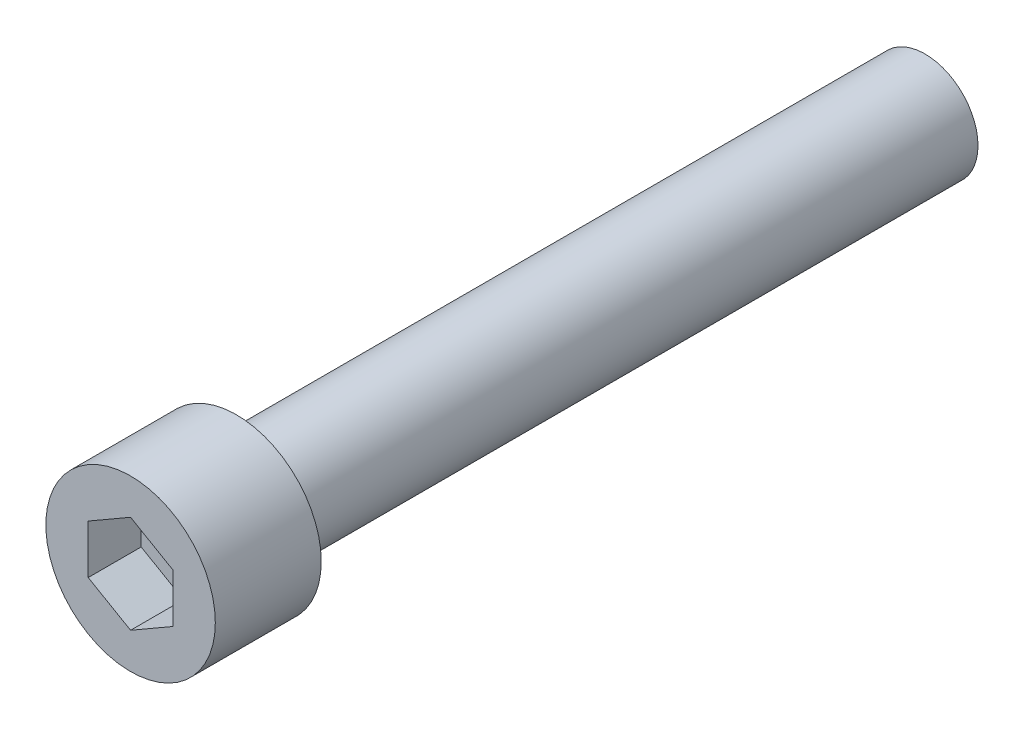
ISO-10303-21;
HEADER;
FILE_DESCRIPTION(('STEP AP214'),'2;1');
FILE_NAME('part.step','',(''),(''),'','','');
FILE_SCHEMA(('AUTOMOTIVE_DESIGN { 1 0 10303 214 1 1 1 1 }'));
ENDSEC;
DATA;
#1=APPLICATION_CONTEXT('core data for automotive mechanical design processes');
#2=APPLICATION_PROTOCOL_DEFINITION('international standard','automotive_design',2000,#1);
#3=PRODUCT_CONTEXT('',#1,'mechanical');
#4=PRODUCT('Part','Part','',(#3));
#5=PRODUCT_RELATED_PRODUCT_CATEGORY('part','',(#4));
#6=PRODUCT_DEFINITION_FORMATION('','',#4);
#7=PRODUCT_DEFINITION_CONTEXT('part definition',#1,'design');
#8=PRODUCT_DEFINITION('design','',#6,#7);
#9=PRODUCT_DEFINITION_SHAPE('','',#8);
#10=(LENGTH_UNIT() NAMED_UNIT(*) SI_UNIT(.MILLI.,.METRE.));
#11=(NAMED_UNIT(*) PLANE_ANGLE_UNIT() SI_UNIT($,.RADIAN.));
#12=(NAMED_UNIT(*) SI_UNIT($,.STERADIAN.) SOLID_ANGLE_UNIT());
#13=UNCERTAINTY_MEASURE_WITH_UNIT(LENGTH_MEASURE(1.E-05),#10,'distance_accuracy_value','');
#14=(GEOMETRIC_REPRESENTATION_CONTEXT(3) GLOBAL_UNCERTAINTY_ASSIGNED_CONTEXT((#13)) GLOBAL_UNIT_ASSIGNED_CONTEXT((#10,
#11,#12)) REPRESENTATION_CONTEXT('',''));
#15=CARTESIAN_POINT('',(0.,0.,0.));
#16=DIRECTION('',(0.,0.,1.));
#17=DIRECTION('',(1.,0.,0.));
#18=AXIS2_PLACEMENT_3D('',#15,#16,#17);
#19=CARTESIAN_POINT('',(0.,4.618802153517,5.));
#20=DIRECTION('',(-0.5,-0.86602540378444,0.));
#21=DIRECTION('',(0.86602540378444,-0.5,0.));
#22=AXIS2_PLACEMENT_3D('',#19,#20,#21);
#23=PLANE('',#22);
#24=DIRECTION('',(0.,0.,1.));
#25=VECTOR('',#24,1.);
#26=CARTESIAN_POINT('',(4.,2.30940107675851,5.));
#27=LINE('',#26,#25);
#28=CARTESIAN_POINT('',(4.,2.30940107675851,5.));
#29=VERTEX_POINT('',#28);
#30=CARTESIAN_POINT('',(4.,2.30940107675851,10.));
#31=VERTEX_POINT('',#30);
#32=EDGE_CURVE('E63',#29,#31,#27,.T.);
#33=ORIENTED_EDGE('',*,*,#32,.T.);
#34=DIRECTION('',(0.86602540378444,-0.5,0.));
#35=VECTOR('',#34,1.);
#36=CARTESIAN_POINT('',(0.,4.618802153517,10.));
#37=LINE('',#36,#35);
#38=CARTESIAN_POINT('',(0.,4.618802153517,10.));
#39=VERTEX_POINT('',#38);
#40=EDGE_CURVE('E29',#39,#31,#37,.T.);
#41=ORIENTED_EDGE('',*,*,#40,.F.);
#42=DIRECTION('',(0.,0.,1.));
#43=VECTOR('',#42,1.);
#44=CARTESIAN_POINT('',(0.,4.618802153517,5.));
#45=LINE('',#44,#43);
#46=CARTESIAN_POINT('',(0.,4.618802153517,5.));
#47=VERTEX_POINT('',#46);
#48=EDGE_CURVE('E33',#47,#39,#45,.T.);
#49=ORIENTED_EDGE('',*,*,#48,.F.);
#50=DIRECTION('',(0.86602540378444,-0.5,0.));
#51=VECTOR('',#50,1.);
#52=CARTESIAN_POINT('',(0.,4.618802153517,5.));
#53=LINE('',#52,#51);
#54=EDGE_CURVE('E65',#47,#29,#53,.T.);
#55=ORIENTED_EDGE('',*,*,#54,.T.);
#56=EDGE_LOOP('',(#33,#41,#49,#55));
#57=FACE_BOUND('',#56,.T.);
#58=ADVANCED_FACE('F14',(#57),#23,.T.);
#59=CARTESIAN_POINT('',(4.,-2.30940107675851,5.));
#60=DIRECTION('',(1.,0.,0.));
#61=DIRECTION('',(0.,1.,0.));
#62=AXIS2_PLACEMENT_3D('',#59,#60,#61);
#63=PLANE('',#62);
#64=DIRECTION('',(0.,0.,1.));
#65=VECTOR('',#64,1.);
#66=CARTESIAN_POINT('',(4.,-2.30940107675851,5.));
#67=LINE('',#66,#65);
#68=CARTESIAN_POINT('',(4.,-2.30940107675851,5.));
#69=VERTEX_POINT('',#68);
#70=CARTESIAN_POINT('',(4.,-2.30940107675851,10.));
#71=VERTEX_POINT('',#70);
#72=EDGE_CURVE('E70',#69,#71,#67,.T.);
#73=ORIENTED_EDGE('',*,*,#72,.T.);
#74=DIRECTION('',(0.,1.,0.));
#75=VECTOR('',#74,1.);
#76=CARTESIAN_POINT('',(4.,-2.30940107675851,10.));
#77=LINE('',#76,#75);
#78=EDGE_CURVE('E73',#71,#31,#77,.T.);
#79=ORIENTED_EDGE('',*,*,#78,.T.);
#80=ORIENTED_EDGE('',*,*,#32,.F.);
#81=DIRECTION('',(0.,1.,0.));
#82=VECTOR('',#81,1.);
#83=CARTESIAN_POINT('',(4.,-2.30940107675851,5.));
#84=LINE('',#83,#82);
#85=EDGE_CURVE('E99',#69,#29,#84,.T.);
#86=ORIENTED_EDGE('',*,*,#85,.F.);
#87=EDGE_LOOP('',(#73,#79,#80,#86));
#88=FACE_BOUND('',#87,.T.);
#89=ADVANCED_FACE('F74',(#88),#63,.F.);
#90=CARTESIAN_POINT('',(0.,-4.618802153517,5.));
#91=DIRECTION('',(0.5,-0.86602540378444,0.));
#92=DIRECTION('',(0.86602540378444,0.5,0.));
#93=AXIS2_PLACEMENT_3D('',#90,#91,#92);
#94=PLANE('',#93);
#95=DIRECTION('',(0.,0.,1.));
#96=VECTOR('',#95,1.);
#97=CARTESIAN_POINT('',(0.,-4.618802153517,5.));
#98=LINE('',#97,#96);
#99=CARTESIAN_POINT('',(0.,-4.618802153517,5.));
#100=VERTEX_POINT('',#99);
#101=CARTESIAN_POINT('',(0.,-4.618802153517,10.));
#102=VERTEX_POINT('',#101);
#103=EDGE_CURVE('E107',#100,#102,#98,.T.);
#104=ORIENTED_EDGE('',*,*,#103,.T.);
#105=DIRECTION('',(0.86602540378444,0.5,0.));
#106=VECTOR('',#105,1.);
#107=CARTESIAN_POINT('',(0.,-4.618802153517,10.));
#108=LINE('',#107,#106);
#109=EDGE_CURVE('E78',#102,#71,#108,.T.);
#110=ORIENTED_EDGE('',*,*,#109,.T.);
#111=ORIENTED_EDGE('',*,*,#72,.F.);
#112=DIRECTION('',(0.86602540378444,0.5,0.));
#113=VECTOR('',#112,1.);
#114=CARTESIAN_POINT('',(0.,-4.618802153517,5.));
#115=LINE('',#114,#113);
#116=EDGE_CURVE('E96',#100,#69,#115,.T.);
#117=ORIENTED_EDGE('',*,*,#116,.F.);
#118=EDGE_LOOP('',(#104,#110,#111,#117));
#119=FACE_BOUND('',#118,.T.);
#120=ADVANCED_FACE('F140',(#119),#94,.F.);
#121=CARTESIAN_POINT('',(0.,-4.618802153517,5.));
#122=DIRECTION('',(0.5,0.86602540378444,0.));
#123=DIRECTION('',(-0.86602540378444,0.5,0.));
#124=AXIS2_PLACEMENT_3D('',#121,#122,#123);
#125=PLANE('',#124);
#126=DIRECTION('',(0.,0.,1.));
#127=VECTOR('',#126,1.);
#128=CARTESIAN_POINT('',(-4.,-2.30940107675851,5.));
#129=LINE('',#128,#127);
#130=CARTESIAN_POINT('',(-4.,-2.30940107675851,5.));
#131=VERTEX_POINT('',#130);
#132=CARTESIAN_POINT('',(-4.,-2.30940107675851,10.));
#133=VERTEX_POINT('',#132);
#134=EDGE_CURVE('E105',#131,#133,#129,.T.);
#135=ORIENTED_EDGE('',*,*,#134,.T.);
#136=DIRECTION('',(-0.86602540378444,0.5,0.));
#137=VECTOR('',#136,1.);
#138=CARTESIAN_POINT('',(0.,-4.618802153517,10.));
#139=LINE('',#138,#137);
#140=EDGE_CURVE('E248',#102,#133,#139,.T.);
#141=ORIENTED_EDGE('',*,*,#140,.F.);
#142=ORIENTED_EDGE('',*,*,#103,.F.);
#143=DIRECTION('',(-0.86602540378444,0.5,0.));
#144=VECTOR('',#143,1.);
#145=CARTESIAN_POINT('',(0.,-4.618802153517,5.));
#146=LINE('',#145,#144);
#147=EDGE_CURVE('E93',#100,#131,#146,.T.);
#148=ORIENTED_EDGE('',*,*,#147,.T.);
#149=EDGE_LOOP('',(#135,#141,#142,#148));
#150=FACE_BOUND('',#149,.T.);
#151=ADVANCED_FACE('F152',(#150),#125,.T.);
#152=CARTESIAN_POINT('',(-4.,2.30940107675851,5.));
#153=DIRECTION('',(-1.,0.,0.));
#154=DIRECTION('',(0.,0.,1.));
#155=AXIS2_PLACEMENT_3D('',#152,#153,#154);
#156=PLANE('',#155);
#157=DIRECTION('',(0.,0.,1.));
#158=VECTOR('',#157,1.);
#159=CARTESIAN_POINT('',(-4.,2.30940107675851,5.));
#160=LINE('',#159,#158);
#161=CARTESIAN_POINT('',(-4.,2.30940107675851,5.));
#162=VERTEX_POINT('',#161);
#163=CARTESIAN_POINT('',(-4.,2.30940107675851,10.));
#164=VERTEX_POINT('',#163);
#165=EDGE_CURVE('E103',#162,#164,#160,.T.);
#166=ORIENTED_EDGE('',*,*,#165,.T.);
#167=DIRECTION('',(0.,-1.,0.));
#168=VECTOR('',#167,1.);
#169=CARTESIAN_POINT('',(-4.,2.30940107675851,10.));
#170=LINE('',#169,#168);
#171=EDGE_CURVE('E249',#164,#133,#170,.T.);
#172=ORIENTED_EDGE('',*,*,#171,.T.);
#173=ORIENTED_EDGE('',*,*,#134,.F.);
#174=DIRECTION('',(0.,-1.,0.));
#175=VECTOR('',#174,1.);
#176=CARTESIAN_POINT('',(-4.,2.30940107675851,5.));
#177=LINE('',#176,#175);
#178=EDGE_CURVE('E90',#162,#131,#177,.T.);
#179=ORIENTED_EDGE('',*,*,#178,.F.);
#180=EDGE_LOOP('',(#166,#172,#173,#179));
#181=FACE_BOUND('',#180,.T.);
#182=ADVANCED_FACE('F148',(#181),#156,.F.);
#183=CARTESIAN_POINT('',(0.,4.618802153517,5.));
#184=DIRECTION('',(-0.5,0.86602540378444,0.));
#185=DIRECTION('',(-0.86602540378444,-0.5,0.));
#186=AXIS2_PLACEMENT_3D('',#183,#184,#185);
#187=PLANE('',#186);
#188=DIRECTION('',(-0.86602540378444,-0.5,0.));
#189=VECTOR('',#188,1.);
#190=CARTESIAN_POINT('',(0.,4.618802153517,5.));
#191=LINE('',#190,#189);
#192=EDGE_CURVE('E87',#47,#162,#191,.T.);
#193=ORIENTED_EDGE('',*,*,#192,.F.);
#194=ORIENTED_EDGE('',*,*,#48,.T.);
#195=DIRECTION('',(-0.86602540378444,-0.5,0.));
#196=VECTOR('',#195,1.);
#197=CARTESIAN_POINT('',(0.,4.618802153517,10.));
#198=LINE('',#197,#196);
#199=EDGE_CURVE('E83',#39,#164,#198,.T.);
#200=ORIENTED_EDGE('',*,*,#199,.T.);
#201=ORIENTED_EDGE('',*,*,#165,.F.);
#202=EDGE_LOOP('',(#193,#194,#200,#201));
#203=FACE_BOUND('',#202,.T.);
#204=ADVANCED_FACE('F145',(#203),#187,.F.);
#205=CARTESIAN_POINT('',(-4.,6.92820323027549,5.));
#206=DIRECTION('',(0.,0.,-1.));
#207=DIRECTION('',(-1.,0.,0.));
#208=AXIS2_PLACEMENT_3D('',#205,#206,#207);
#209=PLANE('',#208);
#210=ORIENTED_EDGE('',*,*,#54,.F.);
#211=ORIENTED_EDGE('',*,*,#192,.T.);
#212=ORIENTED_EDGE('',*,*,#178,.T.);
#213=ORIENTED_EDGE('',*,*,#147,.F.);
#214=ORIENTED_EDGE('',*,*,#116,.T.);
#215=ORIENTED_EDGE('',*,*,#85,.T.);
#216=EDGE_LOOP('',(#210,#211,#212,#213,#214,#215));
#217=FACE_BOUND('',#216,.T.);
#218=ADVANCED_FACE('F144',(#217),#209,.F.);
#219=CARTESIAN_POINT('',(0.,0.,10.));
#220=DIRECTION('',(0.,0.,1.));
#221=DIRECTION('',(1.,0.,0.));
#222=AXIS2_PLACEMENT_3D('',#219,#220,#221);
#223=PLANE('',#222);
#224=CARTESIAN_POINT('',(0.,0.,10.));
#225=DIRECTION('',(0.,0.,1.));
#226=DIRECTION('',(1.,0.,0.));
#227=AXIS2_PLACEMENT_3D('',#224,#225,#226);
#228=CIRCLE('',#227,8.);
#229=CARTESIAN_POINT('',(8.,0.,10.));
#230=VERTEX_POINT('',#229);
#231=EDGE_CURVE('E9',#230,#230,#228,.T.);
#232=ORIENTED_EDGE('',*,*,#231,.T.);
#233=EDGE_LOOP('',(#232));
#234=FACE_BOUND('',#233,.T.);
#235=ORIENTED_EDGE('',*,*,#199,.F.);
#236=ORIENTED_EDGE('',*,*,#40,.T.);
#237=ORIENTED_EDGE('',*,*,#78,.F.);
#238=ORIENTED_EDGE('',*,*,#109,.F.);
#239=ORIENTED_EDGE('',*,*,#140,.T.);
#240=ORIENTED_EDGE('',*,*,#171,.F.);
#241=EDGE_LOOP('',(#235,#236,#237,#238,#239,#240));
#242=FACE_BOUND('',#241,.T.);
#243=ADVANCED_FACE('F16',(#234,#242),#223,.T.);
#244=CARTESIAN_POINT('',(0.,0.,-45.));
#245=DIRECTION('',(0.,0.,1.));
#246=DIRECTION('',(1.,0.,0.));
#247=AXIS2_PLACEMENT_3D('',#244,#245,#246);
#248=CYLINDRICAL_SURFACE('',#247,8.);
#249=CARTESIAN_POINT('',(0.,0.,0.));
#250=DIRECTION('',(0.,0.,1.));
#251=DIRECTION('',(1.,0.,0.));
#252=AXIS2_PLACEMENT_3D('',#249,#250,#251);
#253=CIRCLE('',#252,8.);
#254=CARTESIAN_POINT('',(8.,0.,0.));
#255=VERTEX_POINT('',#254);
#256=EDGE_CURVE('E22',#255,#255,#253,.T.);
#257=ORIENTED_EDGE('',*,*,#256,.T.);
#258=EDGE_LOOP('',(#257));
#259=FACE_BOUND('',#258,.T.);
#260=ORIENTED_EDGE('',*,*,#231,.F.);
#261=EDGE_LOOP('',(#260));
#262=FACE_BOUND('',#261,.T.);
#263=ADVANCED_FACE('F117',(#259,#262),#248,.T.);
#264=CARTESIAN_POINT('',(8.,0.,0.));
#265=DIRECTION('',(0.,0.,-1.));
#266=DIRECTION('',(-1.,0.,0.));
#267=AXIS2_PLACEMENT_3D('',#264,#265,#266);
#268=PLANE('',#267);
#269=CARTESIAN_POINT('',(0.,0.,0.));
#270=DIRECTION('',(0.,0.,1.));
#271=DIRECTION('',(1.,0.,0.));
#272=AXIS2_PLACEMENT_3D('',#269,#270,#271);
#273=CIRCLE('',#272,5.);
#274=CARTESIAN_POINT('',(5.,0.,0.));
#275=VERTEX_POINT('',#274);
#276=EDGE_CURVE('E112',#275,#275,#273,.T.);
#277=ORIENTED_EDGE('',*,*,#276,.T.);
#278=EDGE_LOOP('',(#277));
#279=FACE_BOUND('',#278,.T.);
#280=ORIENTED_EDGE('',*,*,#256,.F.);
#281=EDGE_LOOP('',(#280));
#282=FACE_BOUND('',#281,.T.);
#283=ADVANCED_FACE('F120',(#279,#282),#268,.T.);
#284=CARTESIAN_POINT('',(0.,0.,-45.));
#285=DIRECTION('',(0.,0.,1.));
#286=DIRECTION('',(1.,0.,0.));
#287=AXIS2_PLACEMENT_3D('',#284,#285,#286);
#288=CYLINDRICAL_SURFACE('',#287,5.);
#289=CARTESIAN_POINT('',(0.,0.,-65.));
#290=DIRECTION('',(0.,0.,1.));
#291=DIRECTION('',(1.,0.,0.));
#292=AXIS2_PLACEMENT_3D('',#289,#290,#291);
#293=CIRCLE('',#292,5.);
#294=CARTESIAN_POINT('',(5.,0.,-65.));
#295=VERTEX_POINT('',#294);
#296=EDGE_CURVE('E69',#295,#295,#293,.T.);
#297=ORIENTED_EDGE('',*,*,#296,.T.);
#298=EDGE_LOOP('',(#297));
#299=FACE_BOUND('',#298,.T.);
#300=ORIENTED_EDGE('',*,*,#276,.F.);
#301=EDGE_LOOP('',(#300));
#302=FACE_BOUND('',#301,.T.);
#303=ADVANCED_FACE('F122',(#299,#302),#288,.T.);
#304=CARTESIAN_POINT('',(5.,0.,-65.));
#305=DIRECTION('',(0.,0.,-1.));
#306=DIRECTION('',(-1.,0.,0.));
#307=AXIS2_PLACEMENT_3D('',#304,#305,#306);
#308=PLANE('',#307);
#309=ORIENTED_EDGE('',*,*,#296,.F.);
#310=EDGE_LOOP('',(#309));
#311=FACE_BOUND('',#310,.T.);
#312=ADVANCED_FACE('F131',(#311),#308,.T.);
#313=CLOSED_SHELL('',(#58,#89,#120,#151,#182,#204,#218,#243,#263,#283,#303,#312));
#314=MANIFOLD_SOLID_BREP('B1',#313);
#315=ADVANCED_BREP_SHAPE_REPRESENTATION('',(#18,#314),#14);
#316=SHAPE_DEFINITION_REPRESENTATION(#9,#315);
ENDSEC;
END-ISO-10303-21;
